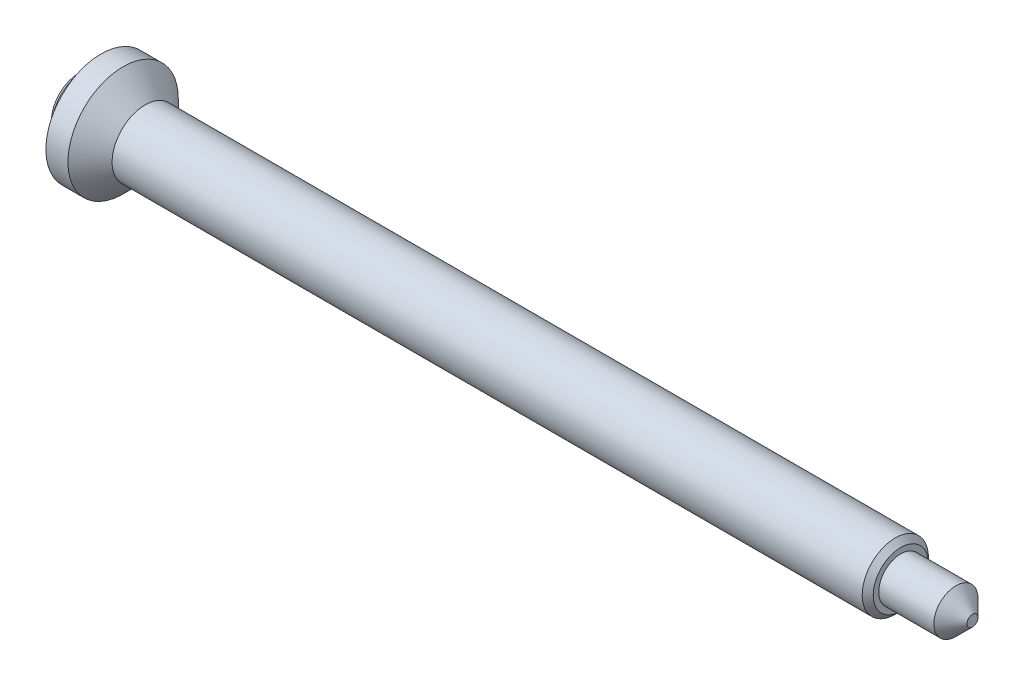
ISO-10303-21;
HEADER;
FILE_DESCRIPTION(('STEP AP214'),'2;1');
FILE_NAME('part.step','',(''),(''),'','','');
FILE_SCHEMA(('AUTOMOTIVE_DESIGN { 1 0 10303 214 1 1 1 1 }'));
ENDSEC;
DATA;
#1=APPLICATION_CONTEXT('core data for automotive mechanical design processes');
#2=APPLICATION_PROTOCOL_DEFINITION('international standard','automotive_design',2000,#1);
#3=PRODUCT_CONTEXT('',#1,'mechanical');
#4=PRODUCT('Part','Part','',(#3));
#5=PRODUCT_RELATED_PRODUCT_CATEGORY('part','',(#4));
#6=PRODUCT_DEFINITION_FORMATION('','',#4);
#7=PRODUCT_DEFINITION_CONTEXT('part definition',#1,'design');
#8=PRODUCT_DEFINITION('design','',#6,#7);
#9=PRODUCT_DEFINITION_SHAPE('','',#8);
#10=(LENGTH_UNIT() NAMED_UNIT(*) SI_UNIT(.MILLI.,.METRE.));
#11=(NAMED_UNIT(*) PLANE_ANGLE_UNIT() SI_UNIT($,.RADIAN.));
#12=(NAMED_UNIT(*) SI_UNIT($,.STERADIAN.) SOLID_ANGLE_UNIT());
#13=UNCERTAINTY_MEASURE_WITH_UNIT(LENGTH_MEASURE(1.E-05),#10,'distance_accuracy_value','');
#14=(GEOMETRIC_REPRESENTATION_CONTEXT(3) GLOBAL_UNCERTAINTY_ASSIGNED_CONTEXT((#13)) GLOBAL_UNIT_ASSIGNED_CONTEXT((#10,
#11,#12)) REPRESENTATION_CONTEXT('',''));
#15=CARTESIAN_POINT('',(0.,0.,0.));
#16=DIRECTION('',(0.,0.,1.));
#17=DIRECTION('',(1.,0.,0.));
#18=AXIS2_PLACEMENT_3D('',#15,#16,#17);
#19=CARTESIAN_POINT('',(-5.99999999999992,0.,0.));
#20=DIRECTION('',(1.,0.,0.));
#21=DIRECTION('',(0.,0.,-1.));
#22=AXIS2_PLACEMENT_3D('',#19,#20,#21);
#23=PLANE('',#22);
#24=CARTESIAN_POINT('',(-5.99999999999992,0.,0.));
#25=DIRECTION('',(1.,0.,0.));
#26=DIRECTION('',(0.,0.,-1.));
#27=AXIS2_PLACEMENT_3D('',#24,#25,#26);
#28=CIRCLE('',#27,2.49992598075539);
#29=CARTESIAN_POINT('',(-5.99999999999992,0.,-2.49992598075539));
#30=VERTEX_POINT('',#29);
#31=EDGE_CURVE('E16',#30,#30,#28,.T.);
#32=ORIENTED_EDGE('',*,*,#31,.F.);
#33=EDGE_LOOP('',(#32));
#34=FACE_BOUND('',#33,.T.);
#35=ADVANCED_FACE('F12',(#34),#23,.F.);
#36=CARTESIAN_POINT('',(-5.49995559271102,0.,0.));
#37=DIRECTION('',(1.,0.,0.));
#38=DIRECTION('',(0.,0.,-1.));
#39=AXIS2_PLACEMENT_3D('',#36,#37,#38);
#40=CONICAL_SURFACE('',#39,2.99995558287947,0.785383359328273);
#41=CARTESIAN_POINT('',(-5.49991117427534,0.,0.));
#42=DIRECTION('',(1.,0.,0.));
#43=DIRECTION('',(0.,0.,-1.));
#44=AXIS2_PLACEMENT_3D('',#41,#42,#43);
#45=CIRCLE('',#44,3.);
#46=CARTESIAN_POINT('',(-5.49991117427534,0.,-3.));
#47=VERTEX_POINT('',#46);
#48=EDGE_CURVE('E46',#47,#47,#45,.T.);
#49=ORIENTED_EDGE('',*,*,#48,.F.);
#50=EDGE_LOOP('',(#49));
#51=FACE_BOUND('',#50,.T.);
#52=ORIENTED_EDGE('',*,*,#31,.T.);
#53=EDGE_LOOP('',(#52));
#54=FACE_BOUND('',#53,.T.);
#55=ADVANCED_FACE('F53',(#51,#54),#40,.T.);
#56=CARTESIAN_POINT('',(75.0000000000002,0.,0.));
#57=DIRECTION('',(1.,0.,0.));
#58=DIRECTION('',(0.,0.,-1.));
#59=AXIS2_PLACEMENT_3D('',#56,#57,#58);
#60=PLANE('',#59);
#61=CARTESIAN_POINT('',(75.0000000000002,0.,0.));
#62=DIRECTION('',(1.,0.,0.));
#63=DIRECTION('',(0.,0.,-1.));
#64=AXIS2_PLACEMENT_3D('',#61,#62,#63);
#65=CIRCLE('',#64,0.499980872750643);
#66=CARTESIAN_POINT('',(75.0000000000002,0.,0.49998087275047));
#67=VERTEX_POINT('',#66);
#68=EDGE_CURVE('E44',#67,#67,#65,.F.);
#69=ORIENTED_EDGE('',*,*,#68,.F.);
#70=EDGE_LOOP('',(#69));
#71=FACE_BOUND('',#70,.T.);
#72=ADVANCED_FACE('F61',(#71),#60,.T.);
#73=CARTESIAN_POINT('',(-5.49997779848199,0.,0.));
#74=DIRECTION('',(1.,0.,0.));
#75=DIRECTION('',(0.,0.,-1.));
#76=AXIS2_PLACEMENT_3D('',#73,#74,#75);
#77=CYLINDRICAL_SURFACE('',#76,3.);
#78=ORIENTED_EDGE('',*,*,#48,.T.);
#79=EDGE_LOOP('',(#78));
#80=FACE_BOUND('',#79,.T.);
#81=CARTESIAN_POINT('',(-3.99999999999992,0.,0.));
#82=DIRECTION('',(1.,0.,0.));
#83=DIRECTION('',(0.,0.,-1.));
#84=AXIS2_PLACEMENT_3D('',#81,#82,#83);
#85=CIRCLE('',#84,3.);
#86=CARTESIAN_POINT('',(-3.99999999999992,0.,-3.));
#87=VERTEX_POINT('',#86);
#88=EDGE_CURVE('E41',#87,#87,#85,.F.);
#89=ORIENTED_EDGE('',*,*,#88,.T.);
#90=EDGE_LOOP('',(#89));
#91=FACE_BOUND('',#90,.T.);
#92=ADVANCED_FACE('F99',(#80,#91),#77,.T.);
#93=CARTESIAN_POINT('',(73.4999548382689,0.,0.));
#94=DIRECTION('',(-1.,0.,0.));
#95=DIRECTION('',(0.,0.,1.));
#96=AXIS2_PLACEMENT_3D('',#93,#94,#95);
#97=CONICAL_SURFACE('',#96,1.99996865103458,0.785379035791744);
#98=CARTESIAN_POINT('',(73.4999234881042,0.,0.));
#99=DIRECTION('',(-1.,0.,0.));
#100=DIRECTION('',(0.,0.,1.));
#101=AXIS2_PLACEMENT_3D('',#98,#99,#100);
#102=CIRCLE('',#101,2.);
#103=CARTESIAN_POINT('',(73.4999234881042,0.,1.99999999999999));
#104=VERTEX_POINT('',#103);
#105=EDGE_CURVE('E38',#104,#104,#102,.T.);
#106=CARTESIAN_POINT('',(73.4999234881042,0.,1.99999999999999));
#107=CARTESIAN_POINT('',(73.5155492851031,0.,1.9843748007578));
#108=CARTESIAN_POINT('',(73.531175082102,0.,1.96874960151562));
#109=CARTESIAN_POINT('',(73.5624266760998,0.,1.93749920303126));
#110=CARTESIAN_POINT('',(73.5780524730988,0.,1.92187400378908));
#111=CARTESIAN_POINT('',(73.6093040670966,0.,1.89062360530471));
#112=CARTESIAN_POINT('',(73.6249298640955,0.,1.87499840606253));
#113=CARTESIAN_POINT('',(73.6561814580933,0.,1.84374800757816));
#114=CARTESIAN_POINT('',(73.6718072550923,0.,1.82812280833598));
#115=CARTESIAN_POINT('',(73.7030588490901,0.,1.79687240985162));
#116=CARTESIAN_POINT('',(73.718684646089,0.,1.78124721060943));
#117=CARTESIAN_POINT('',(73.7499362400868,0.,1.74999681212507));
#118=CARTESIAN_POINT('',(73.7655620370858,0.,1.73437161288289));
#119=CARTESIAN_POINT('',(73.7968136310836,0.,1.70312121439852));
#120=CARTESIAN_POINT('',(73.8124394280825,0.,1.68749601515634));
#121=CARTESIAN_POINT('',(73.8436910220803,0.,1.65624561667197));
#122=CARTESIAN_POINT('',(73.8593168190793,0.,1.64062041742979));
#123=CARTESIAN_POINT('',(73.8905684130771,0.,1.60937001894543));
#124=CARTESIAN_POINT('',(73.906194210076,0.,1.59374481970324));
#125=CARTESIAN_POINT('',(73.9374458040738,0.,1.56249442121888));
#126=CARTESIAN_POINT('',(73.9530716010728,0.,1.5468692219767));
#127=CARTESIAN_POINT('',(73.9843231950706,0.,1.51561882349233));
#128=CARTESIAN_POINT('',(73.9999489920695,0.,1.49999362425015));
#129=CARTESIAN_POINT('',(74.0312005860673,0.,1.46874322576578));
#130=CARTESIAN_POINT('',(74.0468263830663,0.,1.4531180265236));
#131=CARTESIAN_POINT('',(74.0780779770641,0.,1.42186762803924));
#132=CARTESIAN_POINT('',(74.093703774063,0.,1.40624242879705));
#133=CARTESIAN_POINT('',(74.1249553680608,0.,1.37499203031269));
#134=CARTESIAN_POINT('',(74.1405811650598,0.,1.35936683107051));
#135=CARTESIAN_POINT('',(74.1718327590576,0.,1.32811643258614));
#136=CARTESIAN_POINT('',(74.1874585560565,0.,1.31249123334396));
#137=CARTESIAN_POINT('',(74.2187101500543,0.,1.28124083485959));
#138=CARTESIAN_POINT('',(74.2343359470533,0.,1.26561563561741));
#139=CARTESIAN_POINT('',(74.2655875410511,0.,1.23436523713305));
#140=CARTESIAN_POINT('',(74.28121333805,0.,1.21874003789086));
#141=CARTESIAN_POINT('',(74.3124649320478,0.,1.1874896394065));
#142=CARTESIAN_POINT('',(74.3280907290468,0.,1.17186444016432));
#143=CARTESIAN_POINT('',(74.3593423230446,0.,1.14061404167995));
#144=CARTESIAN_POINT('',(74.3749681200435,0.,1.12498884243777));
#145=CARTESIAN_POINT('',(74.4062197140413,0.,1.0937384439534));
#146=CARTESIAN_POINT('',(74.4218455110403,0.,1.07811324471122));
#147=CARTESIAN_POINT('',(74.4530971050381,0.,1.04686284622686));
#148=CARTESIAN_POINT('',(74.468722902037,0.,1.03123764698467));
#149=CARTESIAN_POINT('',(74.4999744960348,0.,0.999987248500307));
#150=CARTESIAN_POINT('',(74.5156002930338,0.,0.984362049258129));
#151=CARTESIAN_POINT('',(74.5468518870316,0.,0.953111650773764));
#152=CARTESIAN_POINT('',(74.5624776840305,0.,0.937486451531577));
#153=CARTESIAN_POINT('',(74.5937292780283,0.,0.906236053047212));
#154=CARTESIAN_POINT('',(74.6093550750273,0.,0.890610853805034));
#155=CARTESIAN_POINT('',(74.6406066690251,0.,0.859360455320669));
#156=CARTESIAN_POINT('',(74.656232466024,0.,0.843735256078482));
#157=CARTESIAN_POINT('',(74.6874840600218,0.,0.812484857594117));
#158=CARTESIAN_POINT('',(74.7031098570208,0.,0.796859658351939));
#159=CARTESIAN_POINT('',(74.7343614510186,0.,0.765609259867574));
#160=CARTESIAN_POINT('',(74.7499872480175,0.,0.749984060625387));
#161=CARTESIAN_POINT('',(74.7812388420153,0.,0.718733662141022));
#162=CARTESIAN_POINT('',(74.7968646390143,0.,0.703108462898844));
#163=CARTESIAN_POINT('',(74.8281162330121,0.,0.671858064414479));
#164=CARTESIAN_POINT('',(74.843742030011,0.,0.656232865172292));
#165=CARTESIAN_POINT('',(74.8749936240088,0.,0.624982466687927));
#166=CARTESIAN_POINT('',(74.8906194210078,0.,0.609357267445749));
#167=CARTESIAN_POINT('',(74.9218710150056,0.,0.578106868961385));
#168=CARTESIAN_POINT('',(74.9374968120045,0.,0.5624816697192));
#169=CARTESIAN_POINT('',(74.9687484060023,0.,0.53123127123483));
#170=CARTESIAN_POINT('',(74.9843742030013,0.,0.515606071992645));
#171=CARTESIAN_POINT('',(75.0000000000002,0.,0.49998087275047));
#172=B_SPLINE_CURVE_WITH_KNOTS('',3,(#106,#107,#108,#109,#110,#111,#112,#113,#114,#115,#116,
#117,#118,#119,#120,#121,#122,#123,#124,#125,#126,#127,#128,#129,#130,#131,#132,#133,#134,#135,
#136,#137,#138,#139,#140,#141,#142,#143,#144,#145,#146,#147,#148,#149,#150,#151,#152,#153,#154,
#155,#156,#157,#158,#159,#160,#161,#162,#163,#164,#165,#166,#167,#168,#169,#170,#171),
.UNSPECIFIED.,.F.,.F.,(4,2,2,2,2,2,2,2,2,2,2,2,2,2,2,2,2,2,2,2,2,2,2,2,2,2,2,2,2,2,2,2,4),(0.,
0.0662933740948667,0.132586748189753,0.19888012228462,0.265173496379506,0.331466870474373,
0.397760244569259,0.464053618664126,0.530346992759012,0.596640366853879,0.662933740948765,
0.729227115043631,0.795520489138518,0.861813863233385,0.928107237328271,0.994400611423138,
1.06069398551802,1.12698735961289,1.19328073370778,1.25957410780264,1.32586748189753,
1.3921608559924,1.45845423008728,1.52474760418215,1.59104097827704,1.6573343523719,
1.72362772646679,1.78992110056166,1.85621447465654,1.92250784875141,1.9888012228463,
2.05509459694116,2.12138797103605),.UNSPECIFIED.);
#173=EDGE_CURVE('BSEAM90',#104,#67,#172,.T.);
#174=ORIENTED_EDGE('',*,*,#105,.F.);
#175=ORIENTED_EDGE('',*,*,#68,.T.);
#176=ORIENTED_EDGE('',*,*,#173,.T.);
#177=ORIENTED_EDGE('',*,*,#173,.F.);
#178=EDGE_LOOP('',(#174,#176,#175,#177));
#179=FACE_BOUND('',#178,.T.);
#180=ADVANCED_FACE('F90',(#179),#97,.T.);
#181=CARTESIAN_POINT('',(-3.99999999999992,0.,0.));
#182=DIRECTION('',(1.,0.,0.));
#183=DIRECTION('',(0.,0.,-1.));
#184=AXIS2_PLACEMENT_3D('',#181,#182,#183);
#185=PLANE('',#184);
#186=ORIENTED_EDGE('',*,*,#88,.F.);
#187=EDGE_LOOP('',(#186));
#188=FACE_BOUND('',#187,.T.);
#189=CARTESIAN_POINT('',(-3.99999999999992,0.,0.));
#190=DIRECTION('',(1.,0.,0.));
#191=DIRECTION('',(0.,0.,-1.));
#192=AXIS2_PLACEMENT_3D('',#189,#190,#191);
#193=CIRCLE('',#192,5.);
#194=CARTESIAN_POINT('',(-3.99999999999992,0.,-5.));
#195=VERTEX_POINT('',#194);
#196=EDGE_CURVE('E35',#195,#195,#193,.T.);
#197=ORIENTED_EDGE('',*,*,#196,.F.);
#198=EDGE_LOOP('',(#197));
#199=FACE_BOUND('',#198,.T.);
#200=ADVANCED_FACE('F88',(#188,#199),#185,.F.);
#201=CARTESIAN_POINT('',(68.4999999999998,0.,0.));
#202=DIRECTION('',(1.,0.,0.));
#203=DIRECTION('',(0.,0.,-1.));
#204=AXIS2_PLACEMENT_3D('',#201,#202,#203);
#205=CYLINDRICAL_SURFACE('',#204,2.);
#206=CARTESIAN_POINT('',(68.4999999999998,0.,0.));
#207=DIRECTION('',(1.,0.,0.));
#208=DIRECTION('',(0.,0.,-1.));
#209=AXIS2_PLACEMENT_3D('',#206,#207,#208);
#210=CIRCLE('',#209,2.);
#211=CARTESIAN_POINT('',(68.4999999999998,0.,-2.));
#212=VERTEX_POINT('',#211);
#213=EDGE_CURVE('E32',#212,#212,#210,.F.);
#214=ORIENTED_EDGE('',*,*,#213,.F.);
#215=EDGE_LOOP('',(#214));
#216=FACE_BOUND('',#215,.T.);
#217=ORIENTED_EDGE('',*,*,#105,.T.);
#218=EDGE_LOOP('',(#217));
#219=FACE_BOUND('',#218,.T.);
#220=ADVANCED_FACE('F84',(#216,#219),#205,.T.);
#221=CARTESIAN_POINT('',(-3.99999999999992,0.,0.));
#222=DIRECTION('',(1.,0.,0.));
#223=DIRECTION('',(0.,0.,-1.));
#224=AXIS2_PLACEMENT_3D('',#221,#222,#223);
#225=CYLINDRICAL_SURFACE('',#224,5.);
#226=CARTESIAN_POINT('',(-1.99999999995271,0.,0.));
#227=DIRECTION('',(-1.,0.,0.));
#228=DIRECTION('',(0.,1.,0.));
#229=AXIS2_PLACEMENT_3D('',#226,#227,#228);
#230=CIRCLE('',#229,4.99999999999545);
#231=CARTESIAN_POINT('',(-1.99999999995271,4.99999999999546,0.));
#232=VERTEX_POINT('',#231);
#233=EDGE_CURVE('E29',#232,#232,#230,.F.);
#234=ORIENTED_EDGE('',*,*,#233,.F.);
#235=EDGE_LOOP('',(#234));
#236=FACE_BOUND('',#235,.T.);
#237=ORIENTED_EDGE('',*,*,#196,.T.);
#238=EDGE_LOOP('',(#237));
#239=FACE_BOUND('',#238,.T.);
#240=ADVANCED_FACE('F81',(#236,#239),#225,.T.);
#241=CARTESIAN_POINT('',(68.4999999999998,0.,0.));
#242=DIRECTION('',(1.,0.,0.));
#243=DIRECTION('',(0.,0.,-1.));
#244=AXIS2_PLACEMENT_3D('',#241,#242,#243);
#245=PLANE('',#244);
#246=ORIENTED_EDGE('',*,*,#213,.T.);
#247=EDGE_LOOP('',(#246));
#248=FACE_BOUND('',#247,.T.);
#249=CARTESIAN_POINT('',(68.4999999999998,0.,0.));
#250=DIRECTION('',(1.,0.,0.));
#251=DIRECTION('',(0.,0.,-1.));
#252=AXIS2_PLACEMENT_3D('',#249,#250,#251);
#253=CIRCLE('',#252,2.49992598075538);
#254=CARTESIAN_POINT('',(68.4999999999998,0.,-2.49992598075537));
#255=VERTEX_POINT('',#254);
#256=EDGE_CURVE('E25',#255,#255,#253,.F.);
#257=ORIENTED_EDGE('',*,*,#256,.F.);
#258=EDGE_LOOP('',(#257));
#259=FACE_BOUND('',#258,.T.);
#260=ADVANCED_FACE('F76',(#248,#259),#245,.T.);
#261=CARTESIAN_POINT('',(-1.99999999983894,0.,0.));
#262=DIRECTION('',(-1.,0.,0.));
#263=DIRECTION('',(0.,0.,1.));
#264=AXIS2_PLACEMENT_3D('',#261,#262,#263);
#265=CONICAL_SURFACE('',#264,4.99999999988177,0.785398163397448);
#266=CARTESIAN_POINT('',(0.,0.,0.));
#267=DIRECTION('',(1.,0.,0.));
#268=DIRECTION('',(0.,-1.,0.));
#269=AXIS2_PLACEMENT_3D('',#266,#267,#268);
#270=CIRCLE('',#269,3.);
#271=CARTESIAN_POINT('',(0.,-3.,0.));
#272=VERTEX_POINT('',#271);
#273=EDGE_CURVE('E20',#272,#272,#270,.T.);
#274=ORIENTED_EDGE('',*,*,#273,.F.);
#275=EDGE_LOOP('',(#274));
#276=FACE_BOUND('',#275,.T.);
#277=ORIENTED_EDGE('',*,*,#233,.T.);
#278=EDGE_LOOP('',(#277));
#279=FACE_BOUND('',#278,.T.);
#280=ADVANCED_FACE('F70',(#276,#279),#265,.T.);
#281=CARTESIAN_POINT('',(67.9999485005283,0.,0.));
#282=DIRECTION('',(-1.,0.,0.));
#283=DIRECTION('',(0.,0.,1.));
#284=AXIS2_PLACEMENT_3D('',#281,#282,#283);
#285=CONICAL_SURFACE('',#284,2.99996267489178,0.785383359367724);
#286=CARTESIAN_POINT('',(67.9999111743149,0.,0.));
#287=DIRECTION('',(-1.,0.,0.));
#288=DIRECTION('',(0.,0.,1.));
#289=AXIS2_PLACEMENT_3D('',#286,#287,#288);
#290=CIRCLE('',#289,3.);
#291=CARTESIAN_POINT('',(67.9999111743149,0.,3.));
#292=VERTEX_POINT('',#291);
#293=EDGE_CURVE('E8',#292,#292,#290,.T.);
#294=ORIENTED_EDGE('',*,*,#293,.F.);
#295=EDGE_LOOP('',(#294));
#296=FACE_BOUND('',#295,.T.);
#297=ORIENTED_EDGE('',*,*,#256,.T.);
#298=EDGE_LOOP('',(#297));
#299=FACE_BOUND('',#298,.T.);
#300=ADVANCED_FACE('F65',(#296,#299),#285,.T.);
#301=CARTESIAN_POINT('',(0.,0.,0.));
#302=DIRECTION('',(1.,0.,0.));
#303=DIRECTION('',(0.,0.,-1.));
#304=AXIS2_PLACEMENT_3D('',#301,#302,#303);
#305=CYLINDRICAL_SURFACE('',#304,3.);
#306=ORIENTED_EDGE('',*,*,#273,.T.);
#307=EDGE_LOOP('',(#306));
#308=FACE_BOUND('',#307,.T.);
#309=ORIENTED_EDGE('',*,*,#293,.T.);
#310=EDGE_LOOP('',(#309));
#311=FACE_BOUND('',#310,.T.);
#312=ADVANCED_FACE('F14',(#308,#311),#305,.T.);
#313=CLOSED_SHELL('',(#35,#55,#72,#92,#180,#200,#220,#240,#260,#280,#300,#312));
#314=MANIFOLD_SOLID_BREP('B1',#313);
#315=ADVANCED_BREP_SHAPE_REPRESENTATION('',(#18,#314),#14);
#316=SHAPE_DEFINITION_REPRESENTATION(#9,#315);
ENDSEC;
END-ISO-10303-21;
